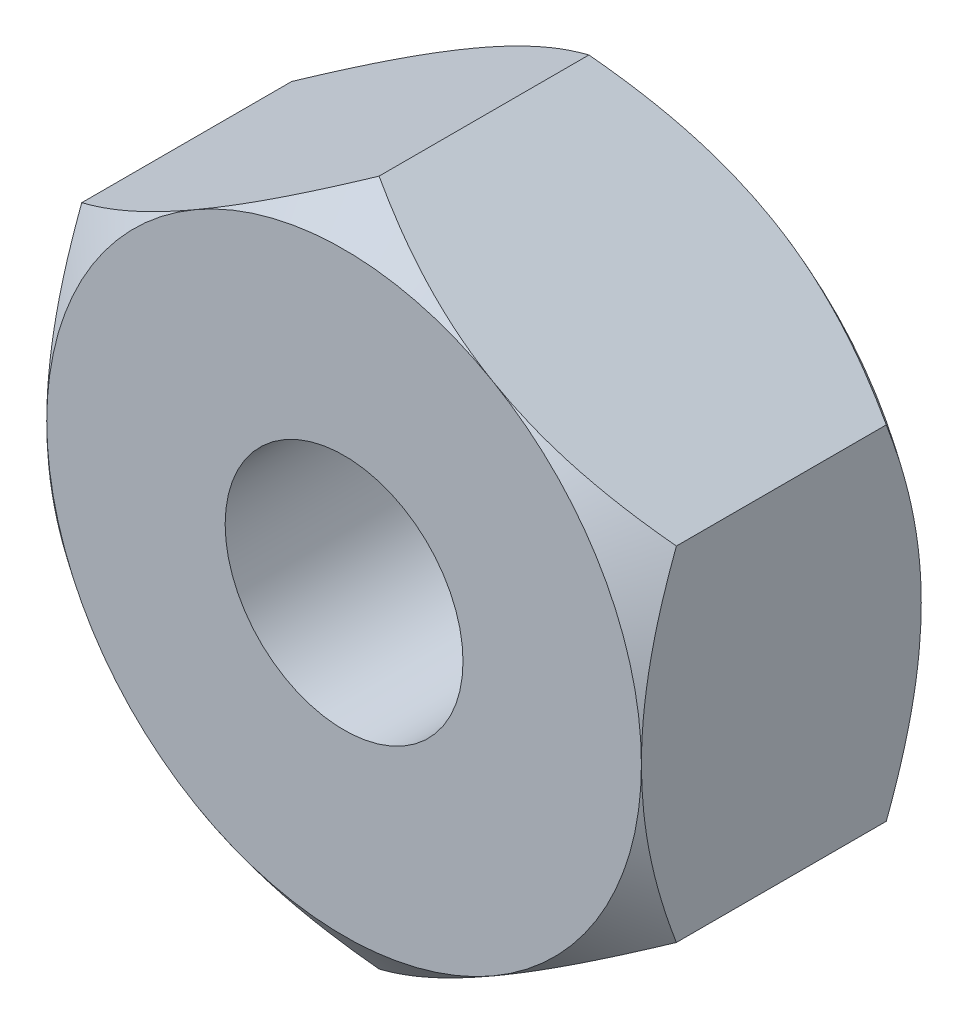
from build123d import *

# Parameters (mm, degrees)
ESQUISSE1_R          = 3.4
BASE_EXTRUSION_DEPTH = 8


with BuildPart() as part:
    # Esquisse1 → Base-Extrusion (new body)
    with BuildSketch(Plane.XY):
        Polygon((8.5, -4.907477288), (8.5, 4.907477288), (0, 9.814954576), (-8.5, 4.907477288), (-8.5, -4.907477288), (0, -9.814954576), align=None)
        Circle(ESQUISSE1_R, mode=Mode.SUBTRACT)
    extrude(amount=BASE_EXTRUSION_DEPTH)

    # Esquisse2 → Enl_vement de mati_re-R_volution1 (revolve, cut)
    with BuildSketch(Plane(origin=(0, 0, 0), x_dir=(0, 1, 0), z_dir=(-1, 0, 0))):
        Polygon((8.5, 0), (9.814954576, 0), (9.814954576, -1), align=None)
        Polygon((9.814954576, -8), (9.814954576, -7), (8.5, -8), align=None)
    revolve(axis=Axis((0, 0, -2.012065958), (0, 0, 1)), mode=Mode.SUBTRACT)


solid = part.part
